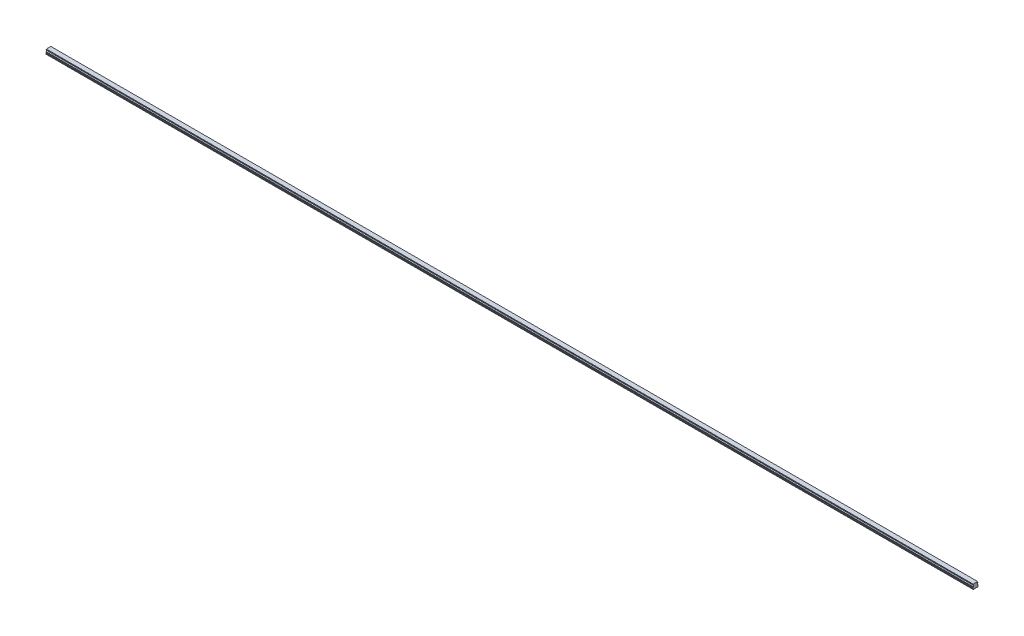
from build123d import *

# Parameters (mm, degrees)
BOSS_EXTRUDE1_DEPTH        = 2700
SKETCH3_R                  = 2.5
SKETCH3_R_2                = 2.1
CUT_EXTRUDE3_DEPTH         = 7
SKETCH3_2_R                = 2.1
CUT_EXTRUDE4_DEPTH         = 9.5
CHAMFER1_SIZE              = 0.4
LPATTERN2_COUNT            = 45
LPATTERN2_PITCH            = 60
CHAMFER1_OF_LPATTERN2_SIZE = 0.4


with BuildPart() as part:
    # Sketch1 → Boss-Extrude1 (new body)
    with BuildSketch(Plane(origin=(0, 0, 0), x_dir=(0, 0, -1), z_dir=(1, 0, 0))):
        with BuildLine():
            Line((6.59, 14), (-6.59, 14))
            Line((-6.59, 14), (-6.59, 13.15))
            Line((-6.59, 13.15), (-6.96, 12.356532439))
            Line((-6.96, 12.356532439), (-6.96, 11.435174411))
            ThreePointArc((-6.96, 11.435174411), (-5.25, 9.5), (-6.96, 7.564825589))
            Line((-6.96, 7.564825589), (-6.96, 6.643467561))
            Line((-6.96, 6.643467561), (-6.59, 5.85))
            Line((-6.59, 5.85), (-7.032116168, 4.2))
            Line((-7.032116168, 4.2), (-7.5, 3.929867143))
            Line((-7.5, 3.929867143), (-7.5, 1.4))
            Line((-7.5, 1.4), (-6.1, 0))
            Line((-6.1, 0), (-3.65, 0))
            Line((-3.65, 0), (-3.25, 0.4))
            Line((-3.25, 0.4), (3.25, 0.4))
            Line((3.25, 0.4), (3.65, 0))
            Line((3.65, 0), (6.1, 0))
            Line((6.1, 0), (7.5, 1.4))
            Line((7.5, 1.4), (7.5, 3.929867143))
            Line((7.5, 3.929867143), (7.032116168, 4.2))
            Line((7.032116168, 4.2), (6.59, 5.85))
            Line((6.59, 5.85), (6.96, 6.643467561))
            Line((6.96, 6.643467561), (6.96, 7.564825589))
            ThreePointArc((6.96, 7.564825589), (5.25, 9.5), (6.96, 11.435174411))
            Line((6.96, 11.435174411), (6.96, 12.356532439))
            Line((6.96, 12.356532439), (6.59, 13.15))
            Line((6.59, 13.15), (6.59, 14))
        make_face()
    extrude(amount=BOSS_EXTRUDE1_DEPTH)

    # Sketch3 → Cut-Extrude3 (cut)
    with BuildSketch(Plane.XZ):
        with Locations(Location((30, 0, 0), (0, 0, 270))):
            Circle(SKETCH3_R)
        with Locations(Location((30, 0, 0), (0, 0, 270))):
            Circle(SKETCH3_R_2, mode=Mode.SUBTRACT)
    cut_extrude3 = extrude(amount=-CUT_EXTRUDE3_DEPTH, mode=Mode.SUBTRACT)

    # Sketch3_2 → Cut-Extrude4 (cut)
    with BuildSketch(Plane.XZ):
        with Locations(Location((30, 0, 0), (0, 0, 270))):
            Circle(SKETCH3_2_R)
    cut_extrude4 = extrude(amount=-CUT_EXTRUDE4_DEPTH, mode=Mode.SUBTRACT)

    # Cut-Extrude5 cone 1 section (on through the dimple's axis) → Cut-Extrude5 (revolve, cut)
    with BuildSketch(Plane(origin=(30, 9.5, 0), x_dir=(0, 0, -1), z_dir=(1, 0, 0))):
        Polygon((0, 0), (2.1, 0), (0, 1.212435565), align=None)
    revolve(axis=Axis((30, 9.5, 0), (0, 1, 0)), mode=Mode.SUBTRACT)

    # Chamfer1
    chamfer1_edges = [part.edges().sort_by_distance(p)[0] for p in [
        (30, 0.4, 2.5),
    ]]
    chamfer(chamfer1_edges, length=CHAMFER1_SIZE)

    # LPattern2: Cut-Extrude3, Cut-Extrude4 ×45
    with Locations(*[(i * LPATTERN2_PITCH, 0, 0) for i in range(1, LPATTERN2_COUNT)]):
        add(cut_extrude3, mode=Mode.SUBTRACT)
        add(cut_extrude4, mode=Mode.SUBTRACT)

    # Chamfer1 of LPattern2
    chamfer1_of_lpattern2_edges = [part.edges().sort_by_distance(p)[0] for p in [
        (90, 0.4, 2.5),
        (150, 0.4, 2.5),
        (210, 0.4, 2.5),
        (270, 0.4, 2.5),
        (330, 0.4, 2.5),
        (390, 0.4, 2.5),
        (450, 0.4, 2.5),
        (510, 0.4, 2.5),
        (570, 0.4, 2.5),
        (630, 0.4, 2.5),
        (690, 0.4, 2.5),
        (750, 0.4, 2.5),
        (810, 0.4, 2.5),
        (870, 0.4, 2.5),
        (930, 0.4, 2.5),
        (990, 0.4, 2.5),
        (1050, 0.4, 2.5),
        (1110, 0.4, 2.5),
        (1170, 0.4, 2.5),
        (1230, 0.4, 2.5),
        (1290, 0.4, 2.5),
        (1350, 0.4, 2.5),
        (1410, 0.4, 2.5),
        (1470, 0.4, 2.5),
        (1530, 0.4, 2.5),
        (1590, 0.4, 2.5),
        (1650, 0.4, 2.5),
        (1710, 0.4, 2.5),
        (1770, 0.4, 2.5),
        (1830, 0.4, 2.5),
        (1890, 0.4, 2.5),
        (1950, 0.4, 2.5),
        (2010, 0.4, 2.5),
        (2070, 0.4, 2.5),
        (2130, 0.4, 2.5),
        (2190, 0.4, 2.5),
        (2250, 0.4, 2.5),
        (2310, 0.4, 2.5),
        (2370, 0.4, 2.5),
        (2430, 0.4, 2.5),
        (2490, 0.4, 2.5),
        (2550, 0.4, 2.5),
        (2610, 0.4, 2.5),
        (2670, 0.4, 2.5),
    ]]
    chamfer(chamfer1_of_lpattern2_edges, length=CHAMFER1_OF_LPATTERN2_SIZE)


solid = part.part
